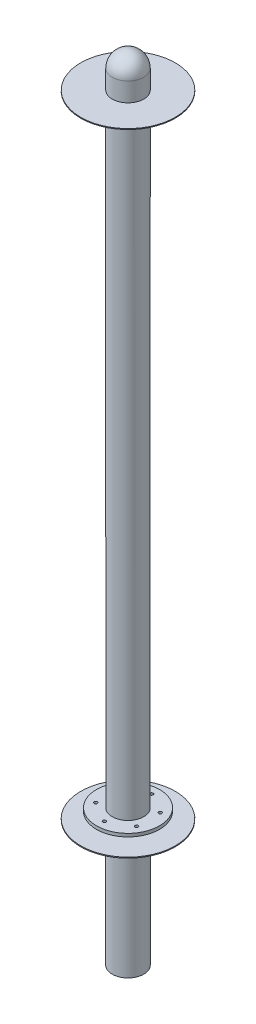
ISO-10303-21;
HEADER;
FILE_DESCRIPTION(('STEP AP214'),'2;1');
FILE_NAME('part.step','',(''),(''),'','','');
FILE_SCHEMA(('AUTOMOTIVE_DESIGN { 1 0 10303 214 1 1 1 1 }'));
ENDSEC;
DATA;
#1=APPLICATION_CONTEXT('core data for automotive mechanical design processes');
#2=APPLICATION_PROTOCOL_DEFINITION('international standard','automotive_design',2000,#1);
#3=PRODUCT_CONTEXT('',#1,'mechanical');
#4=PRODUCT('Part','Part','',(#3));
#5=PRODUCT_RELATED_PRODUCT_CATEGORY('part','',(#4));
#6=PRODUCT_DEFINITION_FORMATION('','',#4);
#7=PRODUCT_DEFINITION_CONTEXT('part definition',#1,'design');
#8=PRODUCT_DEFINITION('design','',#6,#7);
#9=PRODUCT_DEFINITION_SHAPE('','',#8);
#10=(LENGTH_UNIT() NAMED_UNIT(*) SI_UNIT(.MILLI.,.METRE.));
#11=(NAMED_UNIT(*) PLANE_ANGLE_UNIT() SI_UNIT($,.RADIAN.));
#12=(NAMED_UNIT(*) SI_UNIT($,.STERADIAN.) SOLID_ANGLE_UNIT());
#13=UNCERTAINTY_MEASURE_WITH_UNIT(LENGTH_MEASURE(1.E-05),#10,'distance_accuracy_value','');
#14=(GEOMETRIC_REPRESENTATION_CONTEXT(3) GLOBAL_UNCERTAINTY_ASSIGNED_CONTEXT((#13)) GLOBAL_UNIT_ASSIGNED_CONTEXT((#10,
#11,#12)) REPRESENTATION_CONTEXT('',''));
#15=CARTESIAN_POINT('',(0.,0.,0.));
#16=DIRECTION('',(0.,0.,1.));
#17=DIRECTION('',(1.,0.,0.));
#18=AXIS2_PLACEMENT_3D('',#15,#16,#17);
#19=CARTESIAN_POINT('',(0.,2000.,0.));
#20=DIRECTION('',(0.,-1.,0.));
#21=DIRECTION('',(0.,0.,-1.));
#22=AXIS2_PLACEMENT_3D('',#19,#20,#21);
#23=CYLINDRICAL_SURFACE('',#22,50.);
#24=CARTESIAN_POINT('',(0.,1980.,0.));
#25=DIRECTION('',(0.,-1.,0.));
#26=DIRECTION('',(0.,0.,-1.));
#27=AXIS2_PLACEMENT_3D('',#24,#25,#26);
#28=CIRCLE('',#27,50.);
#29=CARTESIAN_POINT('',(0.,1980.,-50.));
#30=VERTEX_POINT('',#29);
#31=EDGE_CURVE('E35',#30,#30,#28,.T.);
#32=ORIENTED_EDGE('',*,*,#31,.T.);
#33=EDGE_LOOP('',(#32));
#34=FACE_BOUND('',#33,.T.);
#35=CARTESIAN_POINT('',(0.,30.,0.));
#36=DIRECTION('',(0.,1.,0.));
#37=DIRECTION('',(0.,0.,1.));
#38=AXIS2_PLACEMENT_3D('',#35,#36,#37);
#39=CIRCLE('',#38,50.);
#40=CARTESIAN_POINT('',(0.,30.,50.));
#41=VERTEX_POINT('',#40);
#42=EDGE_CURVE('E46',#41,#41,#39,.T.);
#43=ORIENTED_EDGE('',*,*,#42,.T.);
#44=EDGE_LOOP('',(#43));
#45=FACE_BOUND('',#44,.T.);
#46=ADVANCED_FACE('F31',(#34,#45),#23,.T.);
#47=CARTESIAN_POINT('',(0.,30.,0.));
#48=DIRECTION('',(0.,1.,0.));
#49=DIRECTION('',(0.,0.,1.));
#50=AXIS2_PLACEMENT_3D('',#47,#48,#49);
#51=PLANE('',#50);
#52=CARTESIAN_POINT('',(-64.9519052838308,30.,-37.4999999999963));
#53=DIRECTION('',(0.,1.,0.));
#54=DIRECTION('',(0.,0.,1.));
#55=AXIS2_PLACEMENT_3D('',#52,#53,#54);
#56=CIRCLE('',#55,5.00000000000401);
#57=CARTESIAN_POINT('',(-64.9519052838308,30.,-32.4999999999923));
#58=VERTEX_POINT('',#57);
#59=EDGE_CURVE('E112',#58,#58,#56,.T.);
#60=ORIENTED_EDGE('',*,*,#59,.F.);
#61=EDGE_LOOP('',(#60));
#62=FACE_BOUND('',#61,.T.);
#63=CARTESIAN_POINT('',(8.50814312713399E-12,30.,75.));
#64=DIRECTION('',(0.,1.,0.));
#65=DIRECTION('',(0.,0.,1.));
#66=AXIS2_PLACEMENT_3D('',#63,#64,#65);
#67=CIRCLE('',#66,5.00000000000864);
#68=CARTESIAN_POINT('',(8.50814312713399E-12,30.,80.0000000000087));
#69=VERTEX_POINT('',#68);
#70=EDGE_CURVE('E100',#69,#69,#67,.T.);
#71=ORIENTED_EDGE('',*,*,#70,.F.);
#72=EDGE_LOOP('',(#71));
#73=FACE_BOUND('',#72,.T.);
#74=CARTESIAN_POINT('',(64.951905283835,30.,-37.5000000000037));
#75=DIRECTION('',(0.,1.,0.));
#76=DIRECTION('',(0.,0.,1.));
#77=AXIS2_PLACEMENT_3D('',#74,#75,#76);
#78=CIRCLE('',#77,5.00000000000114);
#79=CARTESIAN_POINT('',(64.951905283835,30.,-32.5000000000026));
#80=VERTEX_POINT('',#79);
#81=EDGE_CURVE('E88',#80,#80,#78,.T.);
#82=ORIENTED_EDGE('',*,*,#81,.F.);
#83=EDGE_LOOP('',(#82));
#84=FACE_BOUND('',#83,.T.);
#85=CARTESIAN_POINT('',(0.,30.,0.));
#86=DIRECTION('',(0.,1.,0.));
#87=DIRECTION('',(0.,0.,1.));
#88=AXIS2_PLACEMENT_3D('',#85,#86,#87);
#89=CIRCLE('',#88,100.);
#90=CARTESIAN_POINT('',(0.,30.,100.));
#91=VERTEX_POINT('',#90);
#92=EDGE_CURVE('E49',#91,#91,#89,.T.);
#93=ORIENTED_EDGE('',*,*,#92,.T.);
#94=EDGE_LOOP('',(#93));
#95=FACE_BOUND('',#94,.T.);
#96=CARTESIAN_POINT('',(0.,30.,-75.));
#97=DIRECTION('',(0.,1.,0.));
#98=DIRECTION('',(0.,0.,1.));
#99=AXIS2_PLACEMENT_3D('',#96,#97,#98);
#100=CIRCLE('',#99,5.);
#101=CARTESIAN_POINT('',(0.,30.,-70.));
#102=VERTEX_POINT('',#101);
#103=EDGE_CURVE('E82',#102,#102,#100,.T.);
#104=ORIENTED_EDGE('',*,*,#103,.F.);
#105=EDGE_LOOP('',(#104));
#106=FACE_BOUND('',#105,.T.);
#107=CARTESIAN_POINT('',(64.9519052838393,30.,37.4999999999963));
#108=DIRECTION('',(0.,1.,0.));
#109=DIRECTION('',(0.,0.,1.));
#110=AXIS2_PLACEMENT_3D('',#107,#108,#109);
#111=CIRCLE('',#110,5.00000000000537);
#112=CARTESIAN_POINT('',(64.9519052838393,30.,42.5000000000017));
#113=VERTEX_POINT('',#112);
#114=EDGE_CURVE('E94',#113,#113,#111,.T.);
#115=ORIENTED_EDGE('',*,*,#114,.F.);
#116=EDGE_LOOP('',(#115));
#117=FACE_BOUND('',#116,.T.);
#118=CARTESIAN_POINT('',(-64.9519052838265,30.,37.5000000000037));
#119=DIRECTION('',(0.,1.,0.));
#120=DIRECTION('',(0.,0.,1.));
#121=AXIS2_PLACEMENT_3D('',#118,#119,#120);
#122=CIRCLE('',#121,5.00000000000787);
#123=CARTESIAN_POINT('',(-64.9519052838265,30.,42.5000000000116));
#124=VERTEX_POINT('',#123);
#125=EDGE_CURVE('E106',#124,#124,#122,.T.);
#126=ORIENTED_EDGE('',*,*,#125,.F.);
#127=EDGE_LOOP('',(#126));
#128=FACE_BOUND('',#127,.T.);
#129=ORIENTED_EDGE('',*,*,#42,.F.);
#130=EDGE_LOOP('',(#129));
#131=FACE_BOUND('',#130,.T.);
#132=ADVANCED_FACE('F189',(#62,#73,#84,#95,#106,#117,#128,#131),#51,.T.);
#133=CARTESIAN_POINT('',(0.,20.,0.));
#134=DIRECTION('',(0.,1.,0.));
#135=DIRECTION('',(0.,0.,1.));
#136=AXIS2_PLACEMENT_3D('',#133,#134,#135);
#137=PLANE('',#136);
#138=CARTESIAN_POINT('',(-64.9519052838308,20.,-37.4999999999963));
#139=DIRECTION('',(0.,1.,0.));
#140=DIRECTION('',(0.,0.,1.));
#141=AXIS2_PLACEMENT_3D('',#138,#139,#140);
#142=CIRCLE('',#141,5.00000000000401);
#143=CARTESIAN_POINT('',(-64.9519052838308,20.,-32.4999999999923));
#144=VERTEX_POINT('',#143);
#145=EDGE_CURVE('E115',#144,#144,#142,.T.);
#146=ORIENTED_EDGE('',*,*,#145,.T.);
#147=EDGE_LOOP('',(#146));
#148=FACE_BOUND('',#147,.T.);
#149=CARTESIAN_POINT('',(8.50814312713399E-12,20.,75.));
#150=DIRECTION('',(0.,1.,0.));
#151=DIRECTION('',(0.,0.,1.));
#152=AXIS2_PLACEMENT_3D('',#149,#150,#151);
#153=CIRCLE('',#152,5.00000000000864);
#154=CARTESIAN_POINT('',(8.50814312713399E-12,20.,80.0000000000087));
#155=VERTEX_POINT('',#154);
#156=EDGE_CURVE('E103',#155,#155,#153,.T.);
#157=ORIENTED_EDGE('',*,*,#156,.T.);
#158=EDGE_LOOP('',(#157));
#159=FACE_BOUND('',#158,.T.);
#160=CARTESIAN_POINT('',(64.951905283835,20.,-37.5000000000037));
#161=DIRECTION('',(0.,1.,0.));
#162=DIRECTION('',(0.,0.,1.));
#163=AXIS2_PLACEMENT_3D('',#160,#161,#162);
#164=CIRCLE('',#163,5.00000000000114);
#165=CARTESIAN_POINT('',(64.951905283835,20.,-32.5000000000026));
#166=VERTEX_POINT('',#165);
#167=EDGE_CURVE('E91',#166,#166,#164,.T.);
#168=ORIENTED_EDGE('',*,*,#167,.T.);
#169=EDGE_LOOP('',(#168));
#170=FACE_BOUND('',#169,.T.);
#171=CARTESIAN_POINT('',(0.,20.,0.));
#172=DIRECTION('',(0.,1.,0.));
#173=DIRECTION('',(0.,0.,1.));
#174=AXIS2_PLACEMENT_3D('',#171,#172,#173);
#175=CIRCLE('',#174,100.);
#176=CARTESIAN_POINT('',(0.,20.,100.));
#177=VERTEX_POINT('',#176);
#178=EDGE_CURVE('E79',#177,#177,#175,.T.);
#179=ORIENTED_EDGE('',*,*,#178,.F.);
#180=EDGE_LOOP('',(#179));
#181=FACE_BOUND('',#180,.T.);
#182=CARTESIAN_POINT('',(0.,20.,-75.));
#183=DIRECTION('',(0.,1.,0.));
#184=DIRECTION('',(0.,0.,1.));
#185=AXIS2_PLACEMENT_3D('',#182,#183,#184);
#186=CIRCLE('',#185,5.);
#187=CARTESIAN_POINT('',(0.,20.,-70.));
#188=VERTEX_POINT('',#187);
#189=EDGE_CURVE('E85',#188,#188,#186,.T.);
#190=ORIENTED_EDGE('',*,*,#189,.T.);
#191=EDGE_LOOP('',(#190));
#192=FACE_BOUND('',#191,.T.);
#193=CARTESIAN_POINT('',(64.9519052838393,20.,37.4999999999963));
#194=DIRECTION('',(0.,1.,0.));
#195=DIRECTION('',(0.,0.,1.));
#196=AXIS2_PLACEMENT_3D('',#193,#194,#195);
#197=CIRCLE('',#196,5.00000000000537);
#198=CARTESIAN_POINT('',(64.9519052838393,20.,42.5000000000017));
#199=VERTEX_POINT('',#198);
#200=EDGE_CURVE('E97',#199,#199,#197,.T.);
#201=ORIENTED_EDGE('',*,*,#200,.T.);
#202=EDGE_LOOP('',(#201));
#203=FACE_BOUND('',#202,.T.);
#204=CARTESIAN_POINT('',(-64.9519052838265,20.,37.5000000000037));
#205=DIRECTION('',(0.,1.,0.));
#206=DIRECTION('',(0.,0.,1.));
#207=AXIS2_PLACEMENT_3D('',#204,#205,#206);
#208=CIRCLE('',#207,5.00000000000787);
#209=CARTESIAN_POINT('',(-64.9519052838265,20.,42.5000000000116));
#210=VERTEX_POINT('',#209);
#211=EDGE_CURVE('E109',#210,#210,#208,.T.);
#212=ORIENTED_EDGE('',*,*,#211,.T.);
#213=EDGE_LOOP('',(#212));
#214=FACE_BOUND('',#213,.T.);
#215=CARTESIAN_POINT('',(0.,20.,0.));
#216=DIRECTION('',(0.,1.,0.));
#217=DIRECTION('',(0.,0.,1.));
#218=AXIS2_PLACEMENT_3D('',#215,#216,#217);
#219=CIRCLE('',#218,50.);
#220=CARTESIAN_POINT('',(0.,20.,50.));
#221=VERTEX_POINT('',#220);
#222=EDGE_CURVE('E39',#221,#221,#219,.T.);
#223=ORIENTED_EDGE('',*,*,#222,.T.);
#224=EDGE_LOOP('',(#223));
#225=FACE_BOUND('',#224,.T.);
#226=ADVANCED_FACE('F194',(#148,#159,#170,#181,#192,#203,#214,#225),#137,.F.);
#227=CARTESIAN_POINT('',(0.,30.,0.));
#228=DIRECTION('',(0.,-1.,0.));
#229=DIRECTION('',(0.,0.,-1.));
#230=AXIS2_PLACEMENT_3D('',#227,#228,#229);
#231=CYLINDRICAL_SURFACE('',#230,100.);
#232=ORIENTED_EDGE('',*,*,#92,.F.);
#233=EDGE_LOOP('',(#232));
#234=FACE_BOUND('',#233,.T.);
#235=ORIENTED_EDGE('',*,*,#178,.T.);
#236=EDGE_LOOP('',(#235));
#237=FACE_BOUND('',#236,.T.);
#238=ADVANCED_FACE('F200',(#234,#237),#231,.T.);
#239=CARTESIAN_POINT('',(0.,30.,-75.));
#240=DIRECTION('',(0.,-1.,0.));
#241=DIRECTION('',(0.,0.,-1.));
#242=AXIS2_PLACEMENT_3D('',#239,#240,#241);
#243=CYLINDRICAL_SURFACE('',#242,5.);
#244=ORIENTED_EDGE('',*,*,#103,.T.);
#245=EDGE_LOOP('',(#244));
#246=FACE_BOUND('',#245,.T.);
#247=ORIENTED_EDGE('',*,*,#189,.F.);
#248=EDGE_LOOP('',(#247));
#249=FACE_BOUND('',#248,.T.);
#250=ADVANCED_FACE('F206',(#246,#249),#243,.F.);
#251=CARTESIAN_POINT('',(64.951905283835,30.,-37.5000000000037));
#252=DIRECTION('',(0.,-1.,0.));
#253=DIRECTION('',(0.,0.,-1.));
#254=AXIS2_PLACEMENT_3D('',#251,#252,#253);
#255=CYLINDRICAL_SURFACE('',#254,5.00000000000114);
#256=ORIENTED_EDGE('',*,*,#81,.T.);
#257=EDGE_LOOP('',(#256));
#258=FACE_BOUND('',#257,.T.);
#259=ORIENTED_EDGE('',*,*,#167,.F.);
#260=EDGE_LOOP('',(#259));
#261=FACE_BOUND('',#260,.T.);
#262=ADVANCED_FACE('F408',(#258,#261),#255,.F.);
#263=CARTESIAN_POINT('',(64.9519052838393,30.,37.4999999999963));
#264=DIRECTION('',(0.,-1.,0.));
#265=DIRECTION('',(0.,0.,-1.));
#266=AXIS2_PLACEMENT_3D('',#263,#264,#265);
#267=CYLINDRICAL_SURFACE('',#266,5.00000000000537);
#268=ORIENTED_EDGE('',*,*,#114,.T.);
#269=EDGE_LOOP('',(#268));
#270=FACE_BOUND('',#269,.T.);
#271=ORIENTED_EDGE('',*,*,#200,.F.);
#272=EDGE_LOOP('',(#271));
#273=FACE_BOUND('',#272,.T.);
#274=ADVANCED_FACE('F398',(#270,#273),#267,.F.);
#275=CARTESIAN_POINT('',(8.50814312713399E-12,30.,75.));
#276=DIRECTION('',(0.,-1.,0.));
#277=DIRECTION('',(0.,0.,-1.));
#278=AXIS2_PLACEMENT_3D('',#275,#276,#277);
#279=CYLINDRICAL_SURFACE('',#278,5.00000000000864);
#280=ORIENTED_EDGE('',*,*,#70,.T.);
#281=EDGE_LOOP('',(#280));
#282=FACE_BOUND('',#281,.T.);
#283=ORIENTED_EDGE('',*,*,#156,.F.);
#284=EDGE_LOOP('',(#283));
#285=FACE_BOUND('',#284,.T.);
#286=ADVANCED_FACE('F388',(#282,#285),#279,.F.);
#287=CARTESIAN_POINT('',(-64.9519052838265,30.,37.5000000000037));
#288=DIRECTION('',(0.,-1.,0.));
#289=DIRECTION('',(0.,0.,-1.));
#290=AXIS2_PLACEMENT_3D('',#287,#288,#289);
#291=CYLINDRICAL_SURFACE('',#290,5.00000000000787);
#292=ORIENTED_EDGE('',*,*,#125,.T.);
#293=EDGE_LOOP('',(#292));
#294=FACE_BOUND('',#293,.T.);
#295=ORIENTED_EDGE('',*,*,#211,.F.);
#296=EDGE_LOOP('',(#295));
#297=FACE_BOUND('',#296,.T.);
#298=ADVANCED_FACE('F378',(#294,#297),#291,.F.);
#299=CARTESIAN_POINT('',(-64.9519052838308,30.,-37.4999999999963));
#300=DIRECTION('',(0.,-1.,0.));
#301=DIRECTION('',(0.,0.,-1.));
#302=AXIS2_PLACEMENT_3D('',#299,#300,#301);
#303=CYLINDRICAL_SURFACE('',#302,5.00000000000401);
#304=ORIENTED_EDGE('',*,*,#59,.T.);
#305=EDGE_LOOP('',(#304));
#306=FACE_BOUND('',#305,.T.);
#307=ORIENTED_EDGE('',*,*,#145,.F.);
#308=EDGE_LOOP('',(#307));
#309=FACE_BOUND('',#308,.T.);
#310=ADVANCED_FACE('F232',(#306,#309),#303,.F.);
#311=CARTESIAN_POINT('',(0.,-403.,0.));
#312=DIRECTION('',(0.,-1.,0.));
#313=DIRECTION('',(0.,0.,-1.));
#314=AXIS2_PLACEMENT_3D('',#311,#312,#313);
#315=PLANE('',#314);
#316=CARTESIAN_POINT('',(0.,-403.,0.));
#317=DIRECTION('',(0.,-1.,0.));
#318=DIRECTION('',(0.,0.,-1.));
#319=AXIS2_PLACEMENT_3D('',#316,#317,#318);
#320=CIRCLE('',#319,50.);
#321=CARTESIAN_POINT('',(0.,-403.,50.));
#322=VERTEX_POINT('',#321);
#323=EDGE_CURVE('E64',#322,#322,#320,.T.);
#324=ORIENTED_EDGE('',*,*,#323,.T.);
#325=EDGE_LOOP('',(#324));
#326=FACE_BOUND('',#325,.T.);
#327=ADVANCED_FACE('F228',(#326),#315,.T.);
#328=CARTESIAN_POINT('',(0.,-403.,0.));
#329=DIRECTION('',(0.,1.,0.));
#330=DIRECTION('',(0.,0.,1.));
#331=AXIS2_PLACEMENT_3D('',#328,#329,#330);
#332=CYLINDRICAL_SURFACE('',#331,50.);
#333=CARTESIAN_POINT('',(0.,-3.,0.));
#334=DIRECTION('',(0.,-1.,0.));
#335=DIRECTION('',(0.,0.,-1.));
#336=AXIS2_PLACEMENT_3D('',#333,#334,#335);
#337=CIRCLE('',#336,50.);
#338=CARTESIAN_POINT('',(0.,-3.,50.));
#339=VERTEX_POINT('',#338);
#340=EDGE_CURVE('E67',#339,#339,#337,.T.);
#341=CARTESIAN_POINT('',(0.,-403.,50.));
#342=CARTESIAN_POINT('',(0.,-398.833333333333,50.));
#343=CARTESIAN_POINT('',(0.,-394.666666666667,50.));
#344=CARTESIAN_POINT('',(0.,-386.333333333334,50.));
#345=CARTESIAN_POINT('',(0.,-382.166666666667,50.));
#346=CARTESIAN_POINT('',(0.,-373.833333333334,50.));
#347=CARTESIAN_POINT('',(0.,-369.666666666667,50.));
#348=CARTESIAN_POINT('',(0.,-361.333333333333,50.));
#349=CARTESIAN_POINT('',(0.,-357.166666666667,50.));
#350=CARTESIAN_POINT('',(0.,-348.833333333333,50.));
#351=CARTESIAN_POINT('',(0.,-344.666666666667,50.));
#352=CARTESIAN_POINT('',(0.,-336.333333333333,50.));
#353=CARTESIAN_POINT('',(0.,-332.166666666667,50.));
#354=CARTESIAN_POINT('',(0.,-323.833333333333,50.));
#355=CARTESIAN_POINT('',(0.,-319.666666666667,50.));
#356=CARTESIAN_POINT('',(0.,-311.333333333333,50.));
#357=CARTESIAN_POINT('',(0.,-307.166666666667,50.));
#358=CARTESIAN_POINT('',(0.,-298.833333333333,50.));
#359=CARTESIAN_POINT('',(0.,-294.666666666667,50.));
#360=CARTESIAN_POINT('',(0.,-286.333333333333,50.));
#361=CARTESIAN_POINT('',(0.,-282.166666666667,50.));
#362=CARTESIAN_POINT('',(0.,-273.833333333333,50.));
#363=CARTESIAN_POINT('',(0.,-269.666666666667,50.));
#364=CARTESIAN_POINT('',(0.,-261.333333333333,50.));
#365=CARTESIAN_POINT('',(0.,-257.166666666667,50.));
#366=CARTESIAN_POINT('',(0.,-248.833333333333,50.));
#367=CARTESIAN_POINT('',(0.,-244.666666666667,50.));
#368=CARTESIAN_POINT('',(0.,-236.333333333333,50.));
#369=CARTESIAN_POINT('',(0.,-232.166666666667,50.));
#370=CARTESIAN_POINT('',(0.,-223.833333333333,50.));
#371=CARTESIAN_POINT('',(0.,-219.666666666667,50.));
#372=CARTESIAN_POINT('',(0.,-211.333333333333,50.));
#373=CARTESIAN_POINT('',(0.,-207.166666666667,50.));
#374=CARTESIAN_POINT('',(0.,-198.833333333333,50.));
#375=CARTESIAN_POINT('',(0.,-194.666666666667,50.));
#376=CARTESIAN_POINT('',(0.,-186.333333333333,50.));
#377=CARTESIAN_POINT('',(0.,-182.166666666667,50.));
#378=CARTESIAN_POINT('',(0.,-173.833333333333,50.));
#379=CARTESIAN_POINT('',(0.,-169.666666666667,50.));
#380=CARTESIAN_POINT('',(0.,-161.333333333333,50.));
#381=CARTESIAN_POINT('',(0.,-157.166666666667,50.));
#382=CARTESIAN_POINT('',(0.,-148.833333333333,50.));
#383=CARTESIAN_POINT('',(0.,-144.666666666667,50.));
#384=CARTESIAN_POINT('',(0.,-136.333333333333,50.));
#385=CARTESIAN_POINT('',(0.,-132.166666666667,50.));
#386=CARTESIAN_POINT('',(0.,-123.833333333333,50.));
#387=CARTESIAN_POINT('',(0.,-119.666666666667,50.));
#388=CARTESIAN_POINT('',(0.,-111.333333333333,50.));
#389=CARTESIAN_POINT('',(0.,-107.166666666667,50.));
#390=CARTESIAN_POINT('',(0.,-98.8333333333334,50.));
#391=CARTESIAN_POINT('',(0.,-94.6666666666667,50.));
#392=CARTESIAN_POINT('',(0.,-86.3333333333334,50.));
#393=CARTESIAN_POINT('',(0.,-82.1666666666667,50.));
#394=CARTESIAN_POINT('',(0.,-73.8333333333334,50.));
#395=CARTESIAN_POINT('',(0.,-69.6666666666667,50.));
#396=CARTESIAN_POINT('',(0.,-61.3333333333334,50.));
#397=CARTESIAN_POINT('',(0.,-57.1666666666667,50.));
#398=CARTESIAN_POINT('',(0.,-48.8333333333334,50.));
#399=CARTESIAN_POINT('',(0.,-44.6666666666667,50.));
#400=CARTESIAN_POINT('',(0.,-36.3333333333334,50.));
#401=CARTESIAN_POINT('',(0.,-32.1666666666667,50.));
#402=CARTESIAN_POINT('',(0.,-23.8333333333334,50.));
#403=CARTESIAN_POINT('',(0.,-19.6666666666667,50.));
#404=CARTESIAN_POINT('',(0.,-11.3333333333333,50.));
#405=CARTESIAN_POINT('',(0.,-7.16666666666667,50.));
#406=CARTESIAN_POINT('',(0.,-3.,50.));
#407=B_SPLINE_CURVE_WITH_KNOTS('',3,(#341,#342,#343,#344,#345,#346,#347,#348,#349,#350,#351,
#352,#353,#354,#355,#356,#357,#358,#359,#360,#361,#362,#363,#364,#365,#366,#367,#368,#369,#370,
#371,#372,#373,#374,#375,#376,#377,#378,#379,#380,#381,#382,#383,#384,#385,#386,#387,#388,#389,
#390,#391,#392,#393,#394,#395,#396,#397,#398,#399,#400,#401,#402,#403,#404,#405,#406),
.UNSPECIFIED.,.F.,.F.,(4,2,2,2,2,2,2,2,2,2,2,2,2,2,2,2,2,2,2,2,2,2,2,2,2,2,2,2,2,2,2,2,4),(0.,
12.5,25.,37.5,50.,62.5,75.,87.5,100.,112.5,125.,137.5,150.,162.5,175.,187.5,200.,212.5,225.,
237.5,250.,262.5,275.,287.5,300.,312.5,325.,337.5,350.,362.5,375.,387.5,400.),.UNSPECIFIED.);
#408=EDGE_CURVE('BSEAM231',#322,#339,#407,.T.);
#409=ORIENTED_EDGE('',*,*,#323,.F.);
#410=ORIENTED_EDGE('',*,*,#340,.T.);
#411=ORIENTED_EDGE('',*,*,#408,.T.);
#412=ORIENTED_EDGE('',*,*,#408,.F.);
#413=EDGE_LOOP('',(#409,#411,#410,#412));
#414=FACE_BOUND('',#413,.T.);
#415=ADVANCED_FACE('F231',(#414),#332,.T.);
#416=CARTESIAN_POINT('',(0.,-3.,0.));
#417=DIRECTION('',(0.,-1.,0.));
#418=DIRECTION('',(0.,0.,-1.));
#419=AXIS2_PLACEMENT_3D('',#416,#417,#418);
#420=PLANE('',#419);
#421=CARTESIAN_POINT('',(0.,-3.,0.));
#422=DIRECTION('',(0.,-1.,0.));
#423=DIRECTION('',(0.,0.,-1.));
#424=AXIS2_PLACEMENT_3D('',#421,#422,#423);
#425=CIRCLE('',#424,150.);
#426=CARTESIAN_POINT('',(0.,-3.,-150.));
#427=VERTEX_POINT('',#426);
#428=EDGE_CURVE('E60',#427,#427,#425,.T.);
#429=ORIENTED_EDGE('',*,*,#428,.T.);
#430=EDGE_LOOP('',(#429));
#431=FACE_BOUND('',#430,.T.);
#432=ORIENTED_EDGE('',*,*,#340,.F.);
#433=EDGE_LOOP('',(#432));
#434=FACE_BOUND('',#433,.T.);
#435=ADVANCED_FACE('F236',(#431,#434),#420,.T.);
#436=CARTESIAN_POINT('',(0.,-3.,0.));
#437=DIRECTION('',(0.,1.,0.));
#438=DIRECTION('',(0.,0.,1.));
#439=AXIS2_PLACEMENT_3D('',#436,#437,#438);
#440=CYLINDRICAL_SURFACE('',#439,150.);
#441=ORIENTED_EDGE('',*,*,#428,.F.);
#442=EDGE_LOOP('',(#441));
#443=FACE_BOUND('',#442,.T.);
#444=CARTESIAN_POINT('',(0.,0.,0.));
#445=DIRECTION('',(0.,-1.,0.));
#446=DIRECTION('',(0.,0.,-1.));
#447=AXIS2_PLACEMENT_3D('',#444,#445,#446);
#448=CIRCLE('',#447,150.);
#449=CARTESIAN_POINT('',(0.,0.,-150.));
#450=VERTEX_POINT('',#449);
#451=EDGE_CURVE('E61',#450,#450,#448,.T.);
#452=ORIENTED_EDGE('',*,*,#451,.T.);
#453=EDGE_LOOP('',(#452));
#454=FACE_BOUND('',#453,.T.);
#455=ADVANCED_FACE('F240',(#443,#454),#440,.T.);
#456=CARTESIAN_POINT('',(0.,0.,0.));
#457=DIRECTION('',(0.,-1.,0.));
#458=DIRECTION('',(0.,0.,-1.));
#459=AXIS2_PLACEMENT_3D('',#456,#457,#458);
#460=PLANE('',#459);
#461=ORIENTED_EDGE('',*,*,#451,.F.);
#462=EDGE_LOOP('',(#461));
#463=FACE_BOUND('',#462,.T.);
#464=CARTESIAN_POINT('',(0.,0.,0.));
#465=DIRECTION('',(0.,-1.,0.));
#466=DIRECTION('',(0.,0.,-1.));
#467=AXIS2_PLACEMENT_3D('',#464,#465,#466);
#468=CIRCLE('',#467,50.);
#469=CARTESIAN_POINT('',(0.,0.,-50.));
#470=VERTEX_POINT('',#469);
#471=EDGE_CURVE('E57',#470,#470,#468,.T.);
#472=ORIENTED_EDGE('',*,*,#471,.T.);
#473=EDGE_LOOP('',(#472));
#474=FACE_BOUND('',#473,.T.);
#475=ADVANCED_FACE('F242',(#463,#474),#460,.F.);
#476=ORIENTED_EDGE('',*,*,#471,.F.);
#477=EDGE_LOOP('',(#476));
#478=FACE_BOUND('',#477,.T.);
#479=ORIENTED_EDGE('',*,*,#222,.F.);
#480=EDGE_LOOP('',(#479));
#481=FACE_BOUND('',#480,.T.);
#482=ADVANCED_FACE('F170',(#478,#481),#23,.T.);
#483=CARTESIAN_POINT('',(0.,1980.,0.));
#484=DIRECTION('',(0.,-1.,0.));
#485=DIRECTION('',(0.,0.,-1.));
#486=AXIS2_PLACEMENT_3D('',#483,#484,#485);
#487=PLANE('',#486);
#488=CARTESIAN_POINT('',(8.50814312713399E-12,1980.,75.));
#489=DIRECTION('',(0.,-1.,0.));
#490=DIRECTION('',(0.,0.,-1.));
#491=AXIS2_PLACEMENT_3D('',#488,#489,#490);
#492=CIRCLE('',#491,5.00000000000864);
#493=CARTESIAN_POINT('',(8.50814312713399E-12,1980.,69.9999999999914));
#494=VERTEX_POINT('',#493);
#495=EDGE_CURVE('E154',#494,#494,#492,.T.);
#496=ORIENTED_EDGE('',*,*,#495,.F.);
#497=EDGE_LOOP('',(#496));
#498=FACE_BOUND('',#497,.T.);
#499=CARTESIAN_POINT('',(-64.9519052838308,1980.,-37.4999999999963));
#500=DIRECTION('',(0.,-1.,0.));
#501=DIRECTION('',(0.,0.,-1.));
#502=AXIS2_PLACEMENT_3D('',#499,#500,#501);
#503=CIRCLE('',#502,5.00000000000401);
#504=CARTESIAN_POINT('',(-64.9519052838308,1980.,-42.5000000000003));
#505=VERTEX_POINT('',#504);
#506=EDGE_CURVE('E142',#505,#505,#503,.T.);
#507=ORIENTED_EDGE('',*,*,#506,.F.);
#508=EDGE_LOOP('',(#507));
#509=FACE_BOUND('',#508,.T.);
#510=CARTESIAN_POINT('',(64.951905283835,1980.,-37.5000000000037));
#511=DIRECTION('',(0.,-1.,0.));
#512=DIRECTION('',(0.,0.,-1.));
#513=AXIS2_PLACEMENT_3D('',#510,#511,#512);
#514=CIRCLE('',#513,5.00000000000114);
#515=CARTESIAN_POINT('',(64.951905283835,1980.,-42.5000000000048));
#516=VERTEX_POINT('',#515);
#517=EDGE_CURVE('E130',#516,#516,#514,.T.);
#518=ORIENTED_EDGE('',*,*,#517,.F.);
#519=EDGE_LOOP('',(#518));
#520=FACE_BOUND('',#519,.T.);
#521=CARTESIAN_POINT('',(0.,1980.,0.));
#522=DIRECTION('',(0.,-1.,0.));
#523=DIRECTION('',(0.,0.,-1.));
#524=AXIS2_PLACEMENT_3D('',#521,#522,#523);
#525=CIRCLE('',#524,100.);
#526=CARTESIAN_POINT('',(0.,1980.,-100.));
#527=VERTEX_POINT('',#526);
#528=EDGE_CURVE('E123',#527,#527,#525,.T.);
#529=ORIENTED_EDGE('',*,*,#528,.T.);
#530=EDGE_LOOP('',(#529));
#531=FACE_BOUND('',#530,.T.);
#532=CARTESIAN_POINT('',(64.9519052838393,1980.,37.4999999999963));
#533=DIRECTION('',(0.,-1.,0.));
#534=DIRECTION('',(0.,0.,-1.));
#535=AXIS2_PLACEMENT_3D('',#532,#533,#534);
#536=CIRCLE('',#535,5.00000000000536);
#537=CARTESIAN_POINT('',(64.9519052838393,1980.,32.499999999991));
#538=VERTEX_POINT('',#537);
#539=EDGE_CURVE('E124',#538,#538,#536,.T.);
#540=ORIENTED_EDGE('',*,*,#539,.F.);
#541=EDGE_LOOP('',(#540));
#542=FACE_BOUND('',#541,.T.);
#543=CARTESIAN_POINT('',(0.,1980.,-75.));
#544=DIRECTION('',(0.,-1.,0.));
#545=DIRECTION('',(0.,0.,-1.));
#546=AXIS2_PLACEMENT_3D('',#543,#544,#545);
#547=CIRCLE('',#546,5.);
#548=CARTESIAN_POINT('',(0.,1980.,-80.));
#549=VERTEX_POINT('',#548);
#550=EDGE_CURVE('E136',#549,#549,#547,.T.);
#551=ORIENTED_EDGE('',*,*,#550,.F.);
#552=EDGE_LOOP('',(#551));
#553=FACE_BOUND('',#552,.T.);
#554=CARTESIAN_POINT('',(-64.9519052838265,1980.,37.5000000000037));
#555=DIRECTION('',(0.,-1.,0.));
#556=DIRECTION('',(0.,0.,-1.));
#557=AXIS2_PLACEMENT_3D('',#554,#555,#556);
#558=CIRCLE('',#557,5.00000000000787);
#559=CARTESIAN_POINT('',(-64.9519052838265,1980.,32.4999999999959));
#560=VERTEX_POINT('',#559);
#561=EDGE_CURVE('E148',#560,#560,#558,.T.);
#562=ORIENTED_EDGE('',*,*,#561,.F.);
#563=EDGE_LOOP('',(#562));
#564=FACE_BOUND('',#563,.T.);
#565=ORIENTED_EDGE('',*,*,#31,.F.);
#566=EDGE_LOOP('',(#565));
#567=FACE_BOUND('',#566,.T.);
#568=ADVANCED_FACE('F166',(#498,#509,#520,#531,#542,#553,#564,#567),#487,.T.);
#569=CARTESIAN_POINT('',(0.,1990.,0.));
#570=DIRECTION('',(0.,-1.,0.));
#571=DIRECTION('',(0.,0.,-1.));
#572=AXIS2_PLACEMENT_3D('',#569,#570,#571);
#573=PLANE('',#572);
#574=CARTESIAN_POINT('',(8.50814312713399E-12,1990.,75.));
#575=DIRECTION('',(0.,-1.,0.));
#576=DIRECTION('',(0.,0.,-1.));
#577=AXIS2_PLACEMENT_3D('',#574,#575,#576);
#578=CIRCLE('',#577,5.00000000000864);
#579=CARTESIAN_POINT('',(8.50814312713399E-12,1990.,69.9999999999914));
#580=VERTEX_POINT('',#579);
#581=EDGE_CURVE('E157',#580,#580,#578,.T.);
#582=ORIENTED_EDGE('',*,*,#581,.T.);
#583=EDGE_LOOP('',(#582));
#584=FACE_BOUND('',#583,.T.);
#585=CARTESIAN_POINT('',(-64.9519052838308,1990.,-37.4999999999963));
#586=DIRECTION('',(0.,-1.,0.));
#587=DIRECTION('',(0.,0.,-1.));
#588=AXIS2_PLACEMENT_3D('',#585,#586,#587);
#589=CIRCLE('',#588,5.00000000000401);
#590=CARTESIAN_POINT('',(-64.9519052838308,1990.,-42.5000000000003));
#591=VERTEX_POINT('',#590);
#592=EDGE_CURVE('E145',#591,#591,#589,.T.);
#593=ORIENTED_EDGE('',*,*,#592,.T.);
#594=EDGE_LOOP('',(#593));
#595=FACE_BOUND('',#594,.T.);
#596=CARTESIAN_POINT('',(64.951905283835,1990.,-37.5000000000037));
#597=DIRECTION('',(0.,-1.,0.));
#598=DIRECTION('',(0.,0.,-1.));
#599=AXIS2_PLACEMENT_3D('',#596,#597,#598);
#600=CIRCLE('',#599,5.00000000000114);
#601=CARTESIAN_POINT('',(64.951905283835,1990.,-42.5000000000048));
#602=VERTEX_POINT('',#601);
#603=EDGE_CURVE('E133',#602,#602,#600,.T.);
#604=ORIENTED_EDGE('',*,*,#603,.T.);
#605=EDGE_LOOP('',(#604));
#606=FACE_BOUND('',#605,.T.);
#607=CARTESIAN_POINT('',(0.,1990.,0.));
#608=DIRECTION('',(0.,-1.,0.));
#609=DIRECTION('',(0.,0.,-1.));
#610=AXIS2_PLACEMENT_3D('',#607,#608,#609);
#611=CIRCLE('',#610,100.);
#612=CARTESIAN_POINT('',(0.,1990.,-100.));
#613=VERTEX_POINT('',#612);
#614=EDGE_CURVE('E120',#613,#613,#611,.T.);
#615=ORIENTED_EDGE('',*,*,#614,.F.);
#616=EDGE_LOOP('',(#615));
#617=FACE_BOUND('',#616,.T.);
#618=CARTESIAN_POINT('',(64.9519052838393,1990.,37.4999999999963));
#619=DIRECTION('',(0.,-1.,0.));
#620=DIRECTION('',(0.,0.,-1.));
#621=AXIS2_PLACEMENT_3D('',#618,#619,#620);
#622=CIRCLE('',#621,5.00000000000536);
#623=CARTESIAN_POINT('',(64.9519052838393,1990.,32.499999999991));
#624=VERTEX_POINT('',#623);
#625=EDGE_CURVE('E127',#624,#624,#622,.T.);
#626=ORIENTED_EDGE('',*,*,#625,.T.);
#627=EDGE_LOOP('',(#626));
#628=FACE_BOUND('',#627,.T.);
#629=CARTESIAN_POINT('',(0.,1990.,-75.));
#630=DIRECTION('',(0.,-1.,0.));
#631=DIRECTION('',(0.,0.,-1.));
#632=AXIS2_PLACEMENT_3D('',#629,#630,#631);
#633=CIRCLE('',#632,5.);
#634=CARTESIAN_POINT('',(0.,1990.,-80.));
#635=VERTEX_POINT('',#634);
#636=EDGE_CURVE('E139',#635,#635,#633,.T.);
#637=ORIENTED_EDGE('',*,*,#636,.T.);
#638=EDGE_LOOP('',(#637));
#639=FACE_BOUND('',#638,.T.);
#640=CARTESIAN_POINT('',(-64.9519052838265,1990.,37.5000000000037));
#641=DIRECTION('',(0.,-1.,0.));
#642=DIRECTION('',(0.,0.,-1.));
#643=AXIS2_PLACEMENT_3D('',#640,#641,#642);
#644=CIRCLE('',#643,5.00000000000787);
#645=CARTESIAN_POINT('',(-64.9519052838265,1990.,32.4999999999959));
#646=VERTEX_POINT('',#645);
#647=EDGE_CURVE('E151',#646,#646,#644,.T.);
#648=ORIENTED_EDGE('',*,*,#647,.T.);
#649=EDGE_LOOP('',(#648));
#650=FACE_BOUND('',#649,.T.);
#651=CARTESIAN_POINT('',(0.,1990.,0.));
#652=DIRECTION('',(0.,-1.,0.));
#653=DIRECTION('',(0.,0.,-1.));
#654=AXIS2_PLACEMENT_3D('',#651,#652,#653);
#655=CIRCLE('',#654,50.);
#656=CARTESIAN_POINT('',(0.,1990.,-50.));
#657=VERTEX_POINT('',#656);
#658=EDGE_CURVE('E10',#657,#657,#655,.T.);
#659=ORIENTED_EDGE('',*,*,#658,.T.);
#660=EDGE_LOOP('',(#659));
#661=FACE_BOUND('',#660,.T.);
#662=ADVANCED_FACE('F169',(#584,#595,#606,#617,#628,#639,#650,#661),#573,.F.);
#663=CARTESIAN_POINT('',(0.,1980.,0.));
#664=DIRECTION('',(0.,1.,0.));
#665=DIRECTION('',(0.,0.,1.));
#666=AXIS2_PLACEMENT_3D('',#663,#664,#665);
#667=CYLINDRICAL_SURFACE('',#666,100.);
#668=ORIENTED_EDGE('',*,*,#528,.F.);
#669=EDGE_LOOP('',(#668));
#670=FACE_BOUND('',#669,.T.);
#671=ORIENTED_EDGE('',*,*,#614,.T.);
#672=EDGE_LOOP('',(#671));
#673=FACE_BOUND('',#672,.T.);
#674=ADVANCED_FACE('F337',(#670,#673),#667,.T.);
#675=CARTESIAN_POINT('',(64.9519052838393,1980.,37.4999999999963));
#676=DIRECTION('',(0.,1.,0.));
#677=DIRECTION('',(0.,0.,1.));
#678=AXIS2_PLACEMENT_3D('',#675,#676,#677);
#679=CYLINDRICAL_SURFACE('',#678,5.00000000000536);
#680=ORIENTED_EDGE('',*,*,#539,.T.);
#681=EDGE_LOOP('',(#680));
#682=FACE_BOUND('',#681,.T.);
#683=ORIENTED_EDGE('',*,*,#625,.F.);
#684=EDGE_LOOP('',(#683));
#685=FACE_BOUND('',#684,.T.);
#686=ADVANCED_FACE('F329',(#682,#685),#679,.F.);
#687=CARTESIAN_POINT('',(64.951905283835,1980.,-37.5000000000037));
#688=DIRECTION('',(0.,1.,0.));
#689=DIRECTION('',(0.,0.,1.));
#690=AXIS2_PLACEMENT_3D('',#687,#688,#689);
#691=CYLINDRICAL_SURFACE('',#690,5.00000000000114);
#692=ORIENTED_EDGE('',*,*,#517,.T.);
#693=EDGE_LOOP('',(#692));
#694=FACE_BOUND('',#693,.T.);
#695=ORIENTED_EDGE('',*,*,#603,.F.);
#696=EDGE_LOOP('',(#695));
#697=FACE_BOUND('',#696,.T.);
#698=ADVANCED_FACE('F321',(#694,#697),#691,.F.);
#699=CARTESIAN_POINT('',(0.,1980.,-75.));
#700=DIRECTION('',(0.,1.,0.));
#701=DIRECTION('',(0.,0.,1.));
#702=AXIS2_PLACEMENT_3D('',#699,#700,#701);
#703=CYLINDRICAL_SURFACE('',#702,5.);
#704=ORIENTED_EDGE('',*,*,#550,.T.);
#705=EDGE_LOOP('',(#704));
#706=FACE_BOUND('',#705,.T.);
#707=ORIENTED_EDGE('',*,*,#636,.F.);
#708=EDGE_LOOP('',(#707));
#709=FACE_BOUND('',#708,.T.);
#710=ADVANCED_FACE('F313',(#706,#709),#703,.F.);
#711=CARTESIAN_POINT('',(-64.9519052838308,1980.,-37.4999999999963));
#712=DIRECTION('',(0.,1.,0.));
#713=DIRECTION('',(0.,0.,1.));
#714=AXIS2_PLACEMENT_3D('',#711,#712,#713);
#715=CYLINDRICAL_SURFACE('',#714,5.00000000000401);
#716=ORIENTED_EDGE('',*,*,#506,.T.);
#717=EDGE_LOOP('',(#716));
#718=FACE_BOUND('',#717,.T.);
#719=ORIENTED_EDGE('',*,*,#592,.F.);
#720=EDGE_LOOP('',(#719));
#721=FACE_BOUND('',#720,.T.);
#722=ADVANCED_FACE('F305',(#718,#721),#715,.F.);
#723=CARTESIAN_POINT('',(-64.9519052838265,1980.,37.5000000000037));
#724=DIRECTION('',(0.,1.,0.));
#725=DIRECTION('',(0.,0.,1.));
#726=AXIS2_PLACEMENT_3D('',#723,#724,#725);
#727=CYLINDRICAL_SURFACE('',#726,5.00000000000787);
#728=ORIENTED_EDGE('',*,*,#561,.T.);
#729=EDGE_LOOP('',(#728));
#730=FACE_BOUND('',#729,.T.);
#731=ORIENTED_EDGE('',*,*,#647,.F.);
#732=EDGE_LOOP('',(#731));
#733=FACE_BOUND('',#732,.T.);
#734=ADVANCED_FACE('F298',(#730,#733),#727,.F.);
#735=CARTESIAN_POINT('',(8.50814312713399E-12,1980.,75.));
#736=DIRECTION('',(0.,1.,0.));
#737=DIRECTION('',(0.,0.,1.));
#738=AXIS2_PLACEMENT_3D('',#735,#736,#737);
#739=CYLINDRICAL_SURFACE('',#738,5.00000000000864);
#740=ORIENTED_EDGE('',*,*,#495,.T.);
#741=EDGE_LOOP('',(#740));
#742=FACE_BOUND('',#741,.T.);
#743=ORIENTED_EDGE('',*,*,#581,.F.);
#744=EDGE_LOOP('',(#743));
#745=FACE_BOUND('',#744,.T.);
#746=ADVANCED_FACE('F163',(#742,#745),#739,.F.);
#747=CARTESIAN_POINT('',(0.,2062.72903007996,0.));
#748=DIRECTION('',(0.,0.,1.));
#749=DIRECTION('',(1.,0.,0.));
#750=AXIS2_PLACEMENT_3D('',#747,#748,#749);
#751=SPHERICAL_SURFACE('',#750,50.);
#752=CARTESIAN_POINT('',(0.,2062.72903007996,0.));
#753=DIRECTION('',(0.,1.,0.));
#754=DIRECTION('',(0.,0.,1.));
#755=AXIS2_PLACEMENT_3D('',#752,#753,#754);
#756=SPHERICAL_SURFACE('',#755,50.);
#757=CARTESIAN_POINT('',(0.,2062.72903007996,0.));
#758=DIRECTION('',(0.,1.,0.));
#759=DIRECTION('',(0.,0.,1.));
#760=AXIS2_PLACEMENT_3D('',#757,#758,#759);
#761=CIRCLE('',#760,50.);
#762=CARTESIAN_POINT('',(0.,2062.72903007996,50.));
#763=VERTEX_POINT('',#762);
#764=EDGE_CURVE('E51',#763,#763,#761,.T.);
#765=ORIENTED_EDGE('',*,*,#764,.T.);
#766=EDGE_LOOP('',(#765));
#767=FACE_BOUND('',#766,.T.);
#768=ADVANCED_FACE('F33',(#767),#756,.T.);
#769=CARTESIAN_POINT('',(0.,2062.72903007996,0.));
#770=DIRECTION('',(0.,-1.,0.));
#771=DIRECTION('',(0.,0.,-1.));
#772=AXIS2_PLACEMENT_3D('',#769,#770,#771);
#773=CYLINDRICAL_SURFACE('',#772,50.);
#774=ORIENTED_EDGE('',*,*,#764,.F.);
#775=EDGE_LOOP('',(#774));
#776=FACE_BOUND('',#775,.T.);
#777=CARTESIAN_POINT('',(0.,2002.72903007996,0.));
#778=DIRECTION('',(0.,1.,0.));
#779=DIRECTION('',(0.,0.,1.));
#780=AXIS2_PLACEMENT_3D('',#777,#778,#779);
#781=CIRCLE('',#780,50.);
#782=CARTESIAN_POINT('',(0.,2002.72903007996,50.));
#783=VERTEX_POINT('',#782);
#784=EDGE_CURVE('E48',#783,#783,#781,.T.);
#785=ORIENTED_EDGE('',*,*,#784,.T.);
#786=EDGE_LOOP('',(#785));
#787=FACE_BOUND('',#786,.T.);
#788=ADVANCED_FACE('F212',(#776,#787),#773,.T.);
#789=CARTESIAN_POINT('',(-229.329937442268,2002.72903007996,-524.320682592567));
#790=DIRECTION('',(0.,1.,0.));
#791=DIRECTION('',(-0.916196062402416,0.,0.400730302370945));
#792=AXIS2_PLACEMENT_3D('',#789,#790,#791);
#793=PLANE('',#792);
#794=CARTESIAN_POINT('',(0.,2002.72903007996,0.));
#795=DIRECTION('',(0.,1.,0.));
#796=DIRECTION('',(0.,0.,1.));
#797=AXIS2_PLACEMENT_3D('',#794,#795,#796);
#798=CIRCLE('',#797,150.);
#799=CARTESIAN_POINT('',(0.,2002.72903007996,150.));
#800=VERTEX_POINT('',#799);
#801=EDGE_CURVE('E70',#800,#800,#798,.T.);
#802=ORIENTED_EDGE('',*,*,#801,.T.);
#803=EDGE_LOOP('',(#802));
#804=FACE_BOUND('',#803,.T.);
#805=ORIENTED_EDGE('',*,*,#784,.F.);
#806=EDGE_LOOP('',(#805));
#807=FACE_BOUND('',#806,.T.);
#808=ADVANCED_FACE('F215',(#804,#807),#793,.T.);
#809=CARTESIAN_POINT('',(0.,2426.99309879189,0.));
#810=DIRECTION('',(0.,-1.,0.));
#811=DIRECTION('',(0.,0.,-1.));
#812=AXIS2_PLACEMENT_3D('',#809,#810,#811);
#813=CYLINDRICAL_SURFACE('',#812,150.);
#814=CARTESIAN_POINT('',(0.,2000.,0.));
#815=DIRECTION('',(0.,1.,0.));
#816=DIRECTION('',(0.,0.,1.));
#817=AXIS2_PLACEMENT_3D('',#814,#815,#816);
#818=CIRCLE('',#817,150.);
#819=CARTESIAN_POINT('',(0.,2000.,150.));
#820=VERTEX_POINT('',#819);
#821=EDGE_CURVE('E54',#820,#820,#818,.T.);
#822=ORIENTED_EDGE('',*,*,#821,.T.);
#823=EDGE_LOOP('',(#822));
#824=FACE_BOUND('',#823,.T.);
#825=ORIENTED_EDGE('',*,*,#801,.F.);
#826=EDGE_LOOP('',(#825));
#827=FACE_BOUND('',#826,.T.);
#828=ADVANCED_FACE('F220',(#824,#827),#813,.T.);
#829=CARTESIAN_POINT('',(0.,2000.,0.));
#830=DIRECTION('',(0.,1.,0.));
#831=DIRECTION('',(0.,0.,1.));
#832=AXIS2_PLACEMENT_3D('',#829,#830,#831);
#833=PLANE('',#832);
#834=ORIENTED_EDGE('',*,*,#821,.F.);
#835=EDGE_LOOP('',(#834));
#836=FACE_BOUND('',#835,.T.);
#837=CARTESIAN_POINT('',(0.,2000.,0.));
#838=DIRECTION('',(0.,1.,0.));
#839=DIRECTION('',(0.,0.,1.));
#840=AXIS2_PLACEMENT_3D('',#837,#838,#839);
#841=CIRCLE('',#840,50.);
#842=CARTESIAN_POINT('',(0.,2000.,50.));
#843=VERTEX_POINT('',#842);
#844=EDGE_CURVE('E43',#843,#843,#841,.T.);
#845=ORIENTED_EDGE('',*,*,#844,.T.);
#846=EDGE_LOOP('',(#845));
#847=FACE_BOUND('',#846,.T.);
#848=ADVANCED_FACE('F217',(#836,#847),#833,.F.);
#849=ORIENTED_EDGE('',*,*,#844,.F.);
#850=EDGE_LOOP('',(#849));
#851=FACE_BOUND('',#850,.T.);
#852=ORIENTED_EDGE('',*,*,#658,.F.);
#853=EDGE_LOOP('',(#852));
#854=FACE_BOUND('',#853,.T.);
#855=ADVANCED_FACE('F190',(#851,#854),#23,.T.);
#856=CLOSED_SHELL('',(#46,#132,#226,#238,#250,#262,#274,#286,#298,#310,#327,#415,#435,#455,#475,
#482,#568,#662,#674,#686,#698,#710,#722,#734,#746,#768,#788,#808,#828,#848,#855));
#857=MANIFOLD_SOLID_BREP('B2',#856);
#858=ADVANCED_BREP_SHAPE_REPRESENTATION('',(#18,#857),#14);
#859=SHAPE_DEFINITION_REPRESENTATION(#9,#858);
ENDSEC;
END-ISO-10303-21;
